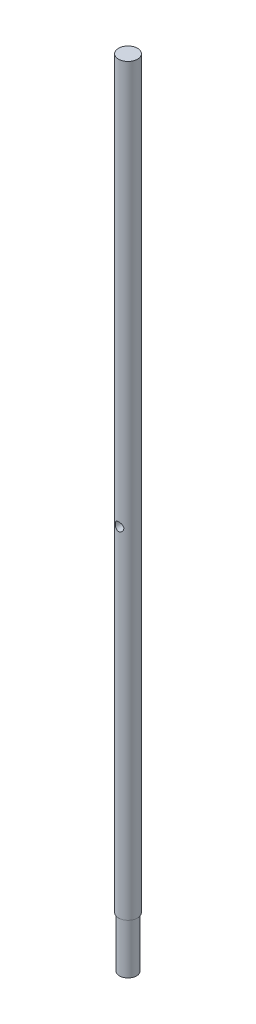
ISO-10303-21;
HEADER;
FILE_DESCRIPTION(('STEP AP214'),'2;1');
FILE_NAME('part.step','',(''),(''),'','','');
FILE_SCHEMA(('AUTOMOTIVE_DESIGN { 1 0 10303 214 1 1 1 1 }'));
ENDSEC;
DATA;
#1=APPLICATION_CONTEXT('core data for automotive mechanical design processes');
#2=APPLICATION_PROTOCOL_DEFINITION('international standard','automotive_design',2000,#1);
#3=PRODUCT_CONTEXT('',#1,'mechanical');
#4=PRODUCT('Part','Part','',(#3));
#5=PRODUCT_RELATED_PRODUCT_CATEGORY('part','',(#4));
#6=PRODUCT_DEFINITION_FORMATION('','',#4);
#7=PRODUCT_DEFINITION_CONTEXT('part definition',#1,'design');
#8=PRODUCT_DEFINITION('design','',#6,#7);
#9=PRODUCT_DEFINITION_SHAPE('','',#8);
#10=(LENGTH_UNIT() NAMED_UNIT(*) SI_UNIT(.MILLI.,.METRE.));
#11=(NAMED_UNIT(*) PLANE_ANGLE_UNIT() SI_UNIT($,.RADIAN.));
#12=(NAMED_UNIT(*) SI_UNIT($,.STERADIAN.) SOLID_ANGLE_UNIT());
#13=UNCERTAINTY_MEASURE_WITH_UNIT(LENGTH_MEASURE(1.E-05),#10,'distance_accuracy_value','');
#14=(GEOMETRIC_REPRESENTATION_CONTEXT(3) GLOBAL_UNCERTAINTY_ASSIGNED_CONTEXT((#13)) GLOBAL_UNIT_ASSIGNED_CONTEXT((#10,
#11,#12)) REPRESENTATION_CONTEXT('',''));
#15=CARTESIAN_POINT('',(0.,0.,0.));
#16=DIRECTION('',(0.,0.,1.));
#17=DIRECTION('',(1.,0.,0.));
#18=AXIS2_PLACEMENT_3D('',#15,#16,#17);
#19=CARTESIAN_POINT('',(0.,398.78,0.));
#20=DIRECTION('',(0.,-1.,0.));
#21=DIRECTION('',(0.,0.,-1.));
#22=AXIS2_PLACEMENT_3D('',#19,#20,#21);
#23=CYLINDRICAL_SURFACE('',#22,4.7625);
#24=CARTESIAN_POINT('',(0.,398.78,0.));
#25=DIRECTION('',(0.,1.,0.));
#26=DIRECTION('',(0.,0.,1.));
#27=AXIS2_PLACEMENT_3D('',#24,#25,#26);
#28=CIRCLE('',#27,4.7625);
#29=CARTESIAN_POINT('',(0.,398.78,4.7625));
#30=VERTEX_POINT('',#29);
#31=EDGE_CURVE('E48',#30,#30,#28,.T.);
#32=ORIENTED_EDGE('',*,*,#31,.F.);
#33=EDGE_LOOP('',(#32));
#34=FACE_BOUND('',#33,.T.);
#35=CARTESIAN_POINT('',(2.15264999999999,195.58,4.24823542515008));
#36=CARTESIAN_POINT('',(2.1526432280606,195.466248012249,4.2482428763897));
#37=CARTESIAN_POINT('',(2.14357510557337,195.352313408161,4.25287141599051));
#38=CARTESIAN_POINT('',(2.10770557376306,195.127818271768,4.27075677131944));
#39=CARTESIAN_POINT('',(2.08086015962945,195.017266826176,4.28403499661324));
#40=CARTESIAN_POINT('',(2.0107451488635,194.803190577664,4.3173829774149));
#41=CARTESIAN_POINT('',(1.96755057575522,194.699636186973,4.33742166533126));
#42=CARTESIAN_POINT('',(1.86618902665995,194.501269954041,4.38198575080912));
#43=CARTESIAN_POINT('',(1.80802377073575,194.406457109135,4.4065106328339));
#44=CARTESIAN_POINT('',(1.67380345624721,194.221243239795,4.45929584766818));
#45=CARTESIAN_POINT('',(1.59681320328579,194.131559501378,4.48769625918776));
#46=CARTESIAN_POINT('',(1.42908468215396,193.965835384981,4.54389092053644));
#47=CARTESIAN_POINT('',(1.33834056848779,193.88980083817,4.57168490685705));
#48=CARTESIAN_POINT('',(1.13982522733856,193.749639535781,4.62528988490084));
#49=CARTESIAN_POINT('',(1.03140911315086,193.686350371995,4.65091945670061));
#50=CARTESIAN_POINT('',(0.804097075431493,193.57922731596,4.69555271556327));
#51=CARTESIAN_POINT('',(0.685206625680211,193.5353833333,4.71455983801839));
#52=CARTESIAN_POINT('',(0.447880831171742,193.471090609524,4.74280725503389));
#53=CARTESIAN_POINT('',(0.329845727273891,193.449396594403,4.75256488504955));
#54=CARTESIAN_POINT('',(0.0914357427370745,193.425964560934,4.76311412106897));
#55=CARTESIAN_POINT('',(-0.0289379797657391,193.42421690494,4.76391005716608));
#56=CARTESIAN_POINT('',(-0.259432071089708,193.440143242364,4.75672735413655));
#57=CARTESIAN_POINT('',(-0.369670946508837,193.456439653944,4.74937106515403));
#58=CARTESIAN_POINT('',(-0.585651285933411,193.505588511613,4.72760020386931));
#59=CARTESIAN_POINT('',(-0.691392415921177,193.538442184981,4.71318510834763));
#60=CARTESIAN_POINT('',(-0.897333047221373,193.620112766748,4.67838447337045));
#61=CARTESIAN_POINT('',(-0.99742419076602,193.66916420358,4.65791170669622));
#62=CARTESIAN_POINT('',(-1.18821658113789,193.781579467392,4.61293504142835));
#63=CARTESIAN_POINT('',(-1.2789143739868,193.844948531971,4.58842966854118));
#64=CARTESIAN_POINT('',(-1.45614592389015,193.990125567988,4.53544680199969));
#65=CARTESIAN_POINT('',(-1.5417512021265,194.073009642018,4.50680834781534));
#66=CARTESIAN_POINT('',(-1.69829169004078,194.251901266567,4.45018596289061));
#67=CARTESIAN_POINT('',(-1.76921910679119,194.347915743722,4.42220238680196));
#68=CARTESIAN_POINT('',(-1.89739943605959,194.555639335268,4.36878978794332));
#69=CARTESIAN_POINT('',(-1.95390741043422,194.667855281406,4.34352884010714));
#70=CARTESIAN_POINT('',(-2.04683255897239,194.901645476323,4.30052719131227));
#71=CARTESIAN_POINT('',(-2.08326699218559,195.023211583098,4.28278003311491));
#72=CARTESIAN_POINT('',(-2.13242499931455,195.26292735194,4.25850610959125));
#73=CARTESIAN_POINT('',(-2.14666983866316,195.380690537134,4.25126208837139));
#74=CARTESIAN_POINT('',(-2.15557416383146,195.617122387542,4.24675659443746));
#75=CARTESIAN_POINT('',(-2.15024270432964,195.735790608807,4.24949050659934));
#76=CARTESIAN_POINT('',(-2.12153910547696,195.960470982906,4.26388199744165));
#77=CARTESIAN_POINT('',(-2.09966572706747,196.066728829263,4.27479759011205));
#78=CARTESIAN_POINT('',(-2.04058040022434,196.273936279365,4.30331333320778));
#79=CARTESIAN_POINT('',(-2.00336441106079,196.374884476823,4.3209152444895));
#80=CARTESIAN_POINT('',(-1.91281372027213,196.573740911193,4.36177889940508));
#81=CARTESIAN_POINT('',(-1.85882594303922,196.671304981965,4.38526067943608));
#82=CARTESIAN_POINT('',(-1.73687730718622,196.856505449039,4.43497418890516));
#83=CARTESIAN_POINT('',(-1.66890975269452,196.944137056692,4.46120723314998));
#84=CARTESIAN_POINT('',(-1.51303374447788,197.116028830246,4.5165942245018));
#85=CARTESIAN_POINT('',(-1.42381782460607,197.199098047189,4.54578041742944));
#86=CARTESIAN_POINT('',(-1.23210439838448,197.349365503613,4.60144332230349));
#87=CARTESIAN_POINT('',(-1.1296047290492,197.416561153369,4.62791959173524));
#88=CARTESIAN_POINT('',(-0.912502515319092,197.533611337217,4.67559716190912));
#89=CARTESIAN_POINT('',(-0.797784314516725,197.583276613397,4.69674022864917));
#90=CARTESIAN_POINT('',(-0.560402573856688,197.662177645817,4.73092933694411));
#91=CARTESIAN_POINT('',(-0.437744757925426,197.691427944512,4.74398114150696));
#92=CARTESIAN_POINT('',(-0.19850860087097,197.726610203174,4.75974986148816));
#93=CARTESIAN_POINT('',(-0.0822235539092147,197.734213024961,4.76320676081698));
#94=CARTESIAN_POINT('',(0.149972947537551,197.730553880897,4.76155229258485));
#95=CARTESIAN_POINT('',(0.265884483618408,197.719296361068,4.75644294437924));
#96=CARTESIAN_POINT('',(0.488370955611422,197.679422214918,4.73864791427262));
#97=CARTESIAN_POINT('',(0.595128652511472,197.651646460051,4.72632966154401));
#98=CARTESIAN_POINT('',(0.802375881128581,197.58052607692,4.6955919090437));
#99=CARTESIAN_POINT('',(0.902864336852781,197.537178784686,4.67717136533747));
#100=CARTESIAN_POINT('',(1.09982190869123,197.433973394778,4.63491184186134));
#101=CARTESIAN_POINT('',(1.19589648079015,197.373450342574,4.61086343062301));
#102=CARTESIAN_POINT('',(1.37694850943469,197.238516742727,4.56007401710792));
#103=CARTESIAN_POINT('',(1.46192112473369,197.164100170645,4.53333184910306));
#104=CARTESIAN_POINT('',(1.62562110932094,196.996362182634,4.47737036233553));
#105=CARTESIAN_POINT('',(1.70327112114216,196.90199298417,4.44812715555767));
#106=CARTESIAN_POINT('',(1.84188725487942,196.70084557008,4.39254460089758));
#107=CARTESIAN_POINT('',(1.90284253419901,196.594059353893,4.36620714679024));
#108=CARTESIAN_POINT('',(2.00642817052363,196.369606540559,4.31959898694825));
#109=CARTESIAN_POINT('',(2.04892960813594,196.251870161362,4.2993712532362));
#110=CARTESIAN_POINT('',(2.0969513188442,196.070527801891,4.27603810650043));
#111=CARTESIAN_POINT('',(2.1103316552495,196.009349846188,4.26943136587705));
#112=CARTESIAN_POINT('',(2.13172900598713,195.885857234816,4.25878921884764));
#113=CARTESIAN_POINT('',(2.13975001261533,195.823543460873,4.25475189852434));
#114=CARTESIAN_POINT('',(2.14756775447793,195.730887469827,4.25080766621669));
#115=CARTESIAN_POINT('',(2.1494722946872,195.700751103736,4.24984459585));
#116=CARTESIAN_POINT('',(2.15201433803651,195.640414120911,4.24855747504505));
#117=CARTESIAN_POINT('',(2.15265179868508,195.610213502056,4.24823344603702));
#118=CARTESIAN_POINT('',(2.15264999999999,195.58,4.24823542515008));
#119=B_SPLINE_CURVE_WITH_KNOTS('',3,(#35,#36,#37,#38,#39,#40,#41,#42,#43,#44,#45,#46,#47,#48,
#49,#50,#51,#52,#53,#54,#55,#56,#57,#58,#59,#60,#61,#62,#63,#64,#65,#66,#67,#68,#69,#70,#71,#72,
#73,#74,#75,#76,#77,#78,#79,#80,#81,#82,#83,#84,#85,#86,#87,#88,#89,#90,#91,#92,#93,#94,#95,#96,
#97,#98,#99,#100,#101,#102,#103,#104,#105,#106,#107,#108,#109,#110,#111,#112,#113,#114,#115,
#116,#117,#118),.UNSPECIFIED.,.T.,.F.,(4,2,2,2,2,2,2,2,2,2,2,2,2,2,2,2,2,2,2,2,2,2,2,2,2,2,2,2,
2,2,2,2,2,2,2,2,2,2,2,2,2,4),(0.,0.341134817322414,0.68311723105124,1.02354900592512,
1.3639416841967,1.72706260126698,2.09033828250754,2.47273818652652,2.85493942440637,
3.21422127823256,3.57332952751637,3.90680146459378,4.24029812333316,4.57885229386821,
4.91753051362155,5.28357198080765,5.64980729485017,6.03226615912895,6.41439567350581,
6.76895059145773,7.12334153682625,7.44898021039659,7.77470470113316,8.11516582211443,
8.45579039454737,8.83010882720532,9.204488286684,9.58279409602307,9.96083014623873,
10.3087733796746,10.6566346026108,10.9881439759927,11.3197100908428,11.6664536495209,
12.0133479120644,12.388582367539,12.7640599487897,13.1421200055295,13.3307991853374,
13.5193376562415,13.609942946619,13.7005512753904),.UNSPECIFIED.);
#120=CARTESIAN_POINT('',(2.15264999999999,195.58,4.24823542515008));
#121=VERTEX_POINT('',#120);
#122=EDGE_CURVE('E44',#121,#121,#119,.T.);
#123=ORIENTED_EDGE('',*,*,#122,.T.);
#124=EDGE_LOOP('',(#123));
#125=FACE_BOUND('',#124,.T.);
#126=CARTESIAN_POINT('',(0.,197.73265,-4.7625));
#127=CARTESIAN_POINT('',(-0.114429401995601,197.732644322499,-4.76249531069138));
#128=CARTESIAN_POINT('',(-0.22903224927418,197.723472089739,-4.75833001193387));
#129=CARTESIAN_POINT('',(-0.454929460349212,197.687151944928,-4.74208164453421));
#130=CARTESIAN_POINT('',(-0.566215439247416,197.659961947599,-4.72998003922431));
#131=CARTESIAN_POINT('',(-0.781854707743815,197.588841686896,-4.69914144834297));
#132=CARTESIAN_POINT('',(-0.886231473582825,197.54497193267,-4.6804284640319));
#133=CARTESIAN_POINT('',(-1.08602437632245,197.442013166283,-4.6381460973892));
#134=CARTESIAN_POINT('',(-1.18144236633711,197.382927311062,-4.61457772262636));
#135=CARTESIAN_POINT('',(-1.36621416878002,197.247676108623,-4.56339019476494));
#136=CARTESIAN_POINT('',(-1.45499257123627,197.170780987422,-4.53562392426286));
#137=CARTESIAN_POINT('',(-1.6189038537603,197.003645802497,-4.4797399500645));
#138=CARTESIAN_POINT('',(-1.69402831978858,196.91339757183,-4.45162204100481));
#139=CARTESIAN_POINT('',(-1.83299843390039,196.71555755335,-4.39630015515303));
#140=CARTESIAN_POINT('',(-1.89589252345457,196.607248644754,-4.36925316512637));
#141=CARTESIAN_POINT('',(-2.00231507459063,196.380204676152,-4.32152369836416));
#142=CARTESIAN_POINT('',(-2.04585520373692,196.26147594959,-4.30083738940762));
#143=CARTESIAN_POINT('',(-2.10985592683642,196.023566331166,-4.26979223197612));
#144=CARTESIAN_POINT('',(-2.13143122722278,195.90475273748,-4.25893805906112));
#145=CARTESIAN_POINT('',(-2.15435083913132,195.664734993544,-4.24739470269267));
#146=CARTESIAN_POINT('',(-2.1557093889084,195.543532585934,-4.24669836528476));
#147=CARTESIAN_POINT('',(-2.13898620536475,195.314275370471,-4.25513794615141));
#148=CARTESIAN_POINT('',(-2.12270532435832,195.206048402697,-4.26336313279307));
#149=CARTESIAN_POINT('',(-2.07422636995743,194.994070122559,-4.28715669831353));
#150=CARTESIAN_POINT('',(-2.04202455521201,194.890319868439,-4.30272680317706));
#151=CARTESIAN_POINT('',(-1.96198062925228,194.68741690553,-4.33981725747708));
#152=CARTESIAN_POINT('',(-1.91380020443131,194.588421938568,-4.36146460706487));
#153=CARTESIAN_POINT('',(-1.8034115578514,194.399495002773,-4.4082538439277));
#154=CARTESIAN_POINT('',(-1.74119734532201,194.309566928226,-4.43339722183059));
#155=CARTESIAN_POINT('',(-1.5971416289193,194.131752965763,-4.4874306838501));
#156=CARTESIAN_POINT('',(-1.51395154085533,194.044993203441,-4.51644253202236));
#157=CARTESIAN_POINT('',(-1.33397327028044,193.886240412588,-4.57283407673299));
#158=CARTESIAN_POINT('',(-1.23718071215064,193.814252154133,-4.60021324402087));
#159=CARTESIAN_POINT('',(-1.02880389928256,193.685019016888,-4.65132439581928));
#160=CARTESIAN_POINT('',(-0.916849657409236,193.628310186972,-4.67491427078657));
#161=CARTESIAN_POINT('',(-0.683649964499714,193.534939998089,-4.71465579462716));
#162=CARTESIAN_POINT('',(-0.562410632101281,193.498265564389,-4.73081229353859));
#163=CARTESIAN_POINT('',(-0.323422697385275,193.448542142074,-4.75291075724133));
#164=CARTESIAN_POINT('',(-0.206047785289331,193.433986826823,-4.75950244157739));
#165=CARTESIAN_POINT('',(0.029646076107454,193.424328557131,-4.76386395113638));
#166=CARTESIAN_POINT('',(0.147964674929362,193.429218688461,-4.76163691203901));
#167=CARTESIAN_POINT('',(0.374612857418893,193.457308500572,-4.74901947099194));
#168=CARTESIAN_POINT('',(0.483113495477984,193.479381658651,-4.73913150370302));
#169=CARTESIAN_POINT('',(0.694712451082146,193.539563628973,-4.71276518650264));
#170=CARTESIAN_POINT('',(0.797810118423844,193.577674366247,-4.6962860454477));
#171=CARTESIAN_POINT('',(0.999323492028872,193.670046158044,-4.65764073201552));
#172=CARTESIAN_POINT('',(1.0974941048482,193.72477233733,-4.63531372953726));
#173=CARTESIAN_POINT('',(1.28361142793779,193.848314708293,-4.58726516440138));
#174=CARTESIAN_POINT('',(1.37155363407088,193.917137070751,-4.56154211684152));
#175=CARTESIAN_POINT('',(1.54242575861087,194.073570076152,-4.50677638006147));
#176=CARTESIAN_POINT('',(1.62433254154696,194.162266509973,-4.47763542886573));
#177=CARTESIAN_POINT('',(1.77245906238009,194.352470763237,-4.42109660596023));
#178=CARTESIAN_POINT('',(1.83867261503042,194.453983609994,-4.3936994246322));
#179=CARTESIAN_POINT('',(1.95505123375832,194.670512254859,-4.34319291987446));
#180=CARTESIAN_POINT('',(2.00474705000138,194.785813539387,-4.32021572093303));
#181=CARTESIAN_POINT('',(2.08353245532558,195.024527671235,-4.28278350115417));
#182=CARTESIAN_POINT('',(2.11264310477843,195.147932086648,-4.26831977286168));
#183=CARTESIAN_POINT('',(2.14717639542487,195.387836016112,-4.2510444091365));
#184=CARTESIAN_POINT('',(2.15443383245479,195.504006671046,-4.24733132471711));
#185=CARTESIAN_POINT('',(2.15012471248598,195.735892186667,-4.24951519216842));
#186=CARTESIAN_POINT('',(2.13856255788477,195.851607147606,-4.25540989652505));
#187=CARTESIAN_POINT('',(2.0985653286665,196.07154948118,-4.27526285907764));
#188=CARTESIAN_POINT('',(2.07126302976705,196.176037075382,-4.28867823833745));
#189=CARTESIAN_POINT('',(2.00178155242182,196.378923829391,-4.32154433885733));
#190=CARTESIAN_POINT('',(1.95959803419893,196.47732120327,-4.34099682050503));
#191=CARTESIAN_POINT('',(1.85842517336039,196.672240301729,-4.38530448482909));
#192=CARTESIAN_POINT('',(1.79852248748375,196.768225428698,-4.41042845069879));
#193=CARTESIAN_POINT('',(1.66477336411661,196.949349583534,-4.46263228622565));
#194=CARTESIAN_POINT('',(1.59092085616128,197.034483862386,-4.48971300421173));
#195=CARTESIAN_POINT('',(1.42336771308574,197.199565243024,-4.5457586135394));
#196=CARTESIAN_POINT('',(1.3284677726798,197.278319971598,-4.57466844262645));
#197=CARTESIAN_POINT('',(1.12580647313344,197.418931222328,-4.62870935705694));
#198=CARTESIAN_POINT('',(1.01803921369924,197.480779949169,-4.653838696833));
#199=CARTESIAN_POINT('',(0.793414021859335,197.584888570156,-4.69732504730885));
#200=CARTESIAN_POINT('',(0.676651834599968,197.627328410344,-4.71574393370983));
#201=CARTESIAN_POINT('',(0.436781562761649,197.691502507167,-4.74395435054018));
#202=CARTESIAN_POINT('',(0.313693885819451,197.713299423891,-4.75377198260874));
#203=CARTESIAN_POINT('',(0.158153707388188,197.727067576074,-4.7599794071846));
#204=CARTESIAN_POINT('',(0.126570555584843,197.729158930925,-4.76092292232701));
#205=CARTESIAN_POINT('',(0.0633293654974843,197.731950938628,-4.76218387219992));
#206=CARTESIAN_POINT('',(0.031671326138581,197.732651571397,-4.76250129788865));
#207=CARTESIAN_POINT('',(0.,197.73265,-4.7625));
#208=B_SPLINE_CURVE_WITH_KNOTS('',3,(#126,#127,#128,#129,#130,#131,#132,#133,#134,#135,#136,
#137,#138,#139,#140,#141,#142,#143,#144,#145,#146,#147,#148,#149,#150,#151,#152,#153,#154,#155,
#156,#157,#158,#159,#160,#161,#162,#163,#164,#165,#166,#167,#168,#169,#170,#171,#172,#173,#174,
#175,#176,#177,#178,#179,#180,#181,#182,#183,#184,#185,#186,#187,#188,#189,#190,#191,#192,#193,
#194,#195,#196,#197,#198,#199,#200,#201,#202,#203,#204,#205,#206,#207),.UNSPECIFIED.,.T.,.F.,(4,
2,2,2,2,2,2,2,2,2,2,2,2,2,2,2,2,2,2,2,2,2,2,2,2,2,2,2,2,2,2,2,2,2,2,2,2,2,2,2,4),(0.,
0.343158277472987,0.687120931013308,1.02984751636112,1.37250305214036,1.73302084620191,
2.09376005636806,2.47622143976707,2.85845194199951,3.22013814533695,3.58156960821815,
3.90930023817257,4.23710792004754,4.5723538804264,4.90774322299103,5.27704849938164,
5.64647284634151,6.02753793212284,6.40835403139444,6.76184650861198,7.11521330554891,
7.44718466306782,7.77919587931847,8.12152568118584,8.46400566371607,8.8349338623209,
9.20600801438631,9.58686754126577,9.96733685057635,10.3148221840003,10.6622262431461,
10.9872914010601,11.3124514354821,11.658723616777,12.0051468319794,12.3833507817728,
12.7617288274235,13.1365239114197,13.5101776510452,13.6051542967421,13.7001323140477),.UNSPECIFIED.);
#209=CARTESIAN_POINT('',(0.,197.73265,-4.7625));
#210=VERTEX_POINT('',#209);
#211=EDGE_CURVE('E10',#210,#210,#208,.T.);
#212=ORIENTED_EDGE('',*,*,#211,.T.);
#213=EDGE_LOOP('',(#212));
#214=FACE_BOUND('',#213,.T.);
#215=CARTESIAN_POINT('',(0.,25.4,0.));
#216=DIRECTION('',(0.,-1.,0.));
#217=DIRECTION('',(0.,0.,-1.));
#218=AXIS2_PLACEMENT_3D('',#215,#216,#217);
#219=CIRCLE('',#218,4.7625);
#220=CARTESIAN_POINT('',(0.,25.4,-4.7625));
#221=VERTEX_POINT('',#220);
#222=EDGE_CURVE('E52',#221,#221,#219,.T.);
#223=ORIENTED_EDGE('',*,*,#222,.F.);
#224=EDGE_LOOP('',(#223));
#225=FACE_BOUND('',#224,.T.);
#226=ADVANCED_FACE('F34',(#34,#125,#214,#225),#23,.T.);
#227=CARTESIAN_POINT('',(0.,398.78,0.));
#228=DIRECTION('',(0.,1.,0.));
#229=DIRECTION('',(0.,0.,1.));
#230=AXIS2_PLACEMENT_3D('',#227,#228,#229);
#231=PLANE('',#230);
#232=ORIENTED_EDGE('',*,*,#31,.T.);
#233=EDGE_LOOP('',(#232));
#234=FACE_BOUND('',#233,.T.);
#235=ADVANCED_FACE('F63',(#234),#231,.T.);
#236=CARTESIAN_POINT('',(0.,195.58,-4.7625));
#237=DIRECTION('',(0.,0.,1.));
#238=DIRECTION('',(1.,0.,0.));
#239=AXIS2_PLACEMENT_3D('',#236,#237,#238);
#240=CYLINDRICAL_SURFACE('',#239,2.15264999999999);
#241=ORIENTED_EDGE('',*,*,#122,.F.);
#242=EDGE_LOOP('',(#241));
#243=FACE_BOUND('',#242,.T.);
#244=ORIENTED_EDGE('',*,*,#211,.F.);
#245=EDGE_LOOP('',(#244));
#246=FACE_BOUND('',#245,.T.);
#247=ADVANCED_FACE('F57',(#243,#246),#240,.F.);
#248=CARTESIAN_POINT('',(0.,25.4,0.));
#249=DIRECTION('',(0.,-1.,0.));
#250=DIRECTION('',(0.,0.,-1.));
#251=AXIS2_PLACEMENT_3D('',#248,#249,#250);
#252=PLANE('',#251);
#253=CARTESIAN_POINT('',(0.,25.4,0.));
#254=DIRECTION('',(0.,-1.,0.));
#255=DIRECTION('',(0.,0.,-1.));
#256=AXIS2_PLACEMENT_3D('',#253,#254,#255);
#257=CIRCLE('',#256,4.31195313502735);
#258=CARTESIAN_POINT('',(0.,25.4,-4.31195313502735));
#259=VERTEX_POINT('',#258);
#260=EDGE_CURVE('E82',#259,#259,#257,.T.);
#261=ORIENTED_EDGE('',*,*,#260,.F.);
#262=EDGE_LOOP('',(#261));
#263=FACE_BOUND('',#262,.T.);
#264=ORIENTED_EDGE('',*,*,#222,.T.);
#265=EDGE_LOOP('',(#264));
#266=FACE_BOUND('',#265,.T.);
#267=ADVANCED_FACE('F62',(#263,#266),#252,.T.);
#268=CARTESIAN_POINT('',(0.,25.4,0.));
#269=DIRECTION('',(0.,-1.,0.));
#270=DIRECTION('',(0.,0.,-1.));
#271=AXIS2_PLACEMENT_3D('',#268,#269,#270);
#272=CYLINDRICAL_SURFACE('',#271,4.31195313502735);
#273=ORIENTED_EDGE('',*,*,#260,.T.);
#274=EDGE_LOOP('',(#273));
#275=FACE_BOUND('',#274,.T.);
#276=CARTESIAN_POINT('',(0.,0.,0.));
#277=DIRECTION('',(0.,-1.,0.));
#278=DIRECTION('',(0.,0.,-1.));
#279=AXIS2_PLACEMENT_3D('',#276,#277,#278);
#280=CIRCLE('',#279,4.31195313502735);
#281=CARTESIAN_POINT('',(0.,0.,-4.31195313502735));
#282=VERTEX_POINT('',#281);
#283=EDGE_CURVE('E84',#282,#282,#280,.T.);
#284=ORIENTED_EDGE('',*,*,#283,.F.);
#285=EDGE_LOOP('',(#284));
#286=FACE_BOUND('',#285,.T.);
#287=ADVANCED_FACE('F69',(#275,#286),#272,.T.);
#288=CARTESIAN_POINT('',(0.,0.,0.));
#289=DIRECTION('',(0.,1.,0.));
#290=DIRECTION('',(0.,0.,1.));
#291=AXIS2_PLACEMENT_3D('',#288,#289,#290);
#292=PLANE('',#291);
#293=ORIENTED_EDGE('',*,*,#283,.T.);
#294=EDGE_LOOP('',(#293));
#295=FACE_BOUND('',#294,.T.);
#296=ADVANCED_FACE('F66',(#295),#292,.F.);
#297=CLOSED_SHELL('',(#226,#235,#247,#267,#287,#296));
#298=MANIFOLD_SOLID_BREP('B2',#297);
#299=ADVANCED_BREP_SHAPE_REPRESENTATION('',(#18,#298),#14);
#300=SHAPE_DEFINITION_REPRESENTATION(#9,#299);
ENDSEC;
END-ISO-10303-21;
